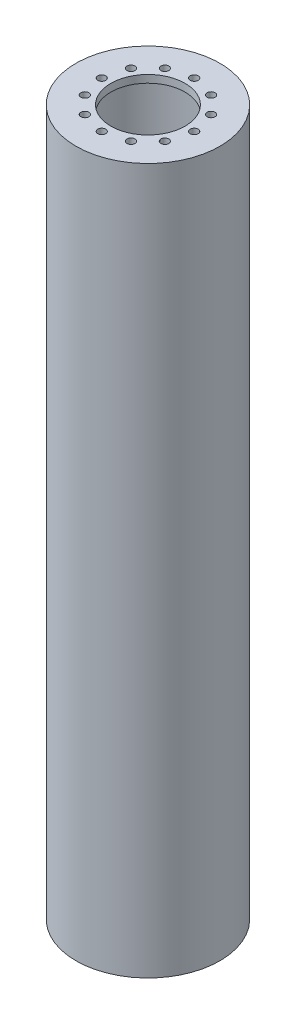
from build123d import *

# Parameters (mm, degrees)
CROQUIS4_R            = 5.25
CORTAR_EXTRUIR2_DEPTH = 10
MATRIZC9_COUNT        = 12


with BuildPart() as part:
    # Croquis1 → Revoluci_n1 (revolve)
    with BuildSketch(Plane.XY, mode=Mode.PRIVATE) as revoluci_n1_sk:
        Polygon((0, -76.123507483), (95, -76.123507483), (95, 855.076492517), (49, 855.076492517), (49, 845.076492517), (85, 845.076492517), (85, -66.123507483), (0, -66.123507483), align=None)
    revolve(revoluci_n1_sk.sketch.rotate(Axis((0, 1016.285514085, 0), (0, -1, 0)), 90), axis=Axis((0, 1016.285514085, 0), (0, -1, 0)))

    # Croquis4 → Cortar-Extruir2 (cut)
    with BuildSketch(Plane(origin=(0, 855.076492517, 0), x_dir=(1, 0, 0), z_dir=(0, 1, 0))):
        with Locations(Location((0, 61, 0), (0, 0, 270))):
            Circle(CROQUIS4_R)
    cortar_extruir2 = extrude(amount=-CORTAR_EXTRUIR2_DEPTH, mode=Mode.SUBTRACT)

    # MatrizC9: Cortar-Extruir2 ×12 about axis
    matrizc9_axis = Axis((0, 0, 0), (0, 1, 0))
    for i in range(1, MATRIZC9_COUNT):
        add(cortar_extruir2.rotate(matrizc9_axis, i * 360 / MATRIZC9_COUNT), mode=Mode.SUBTRACT)


solid = part.part
